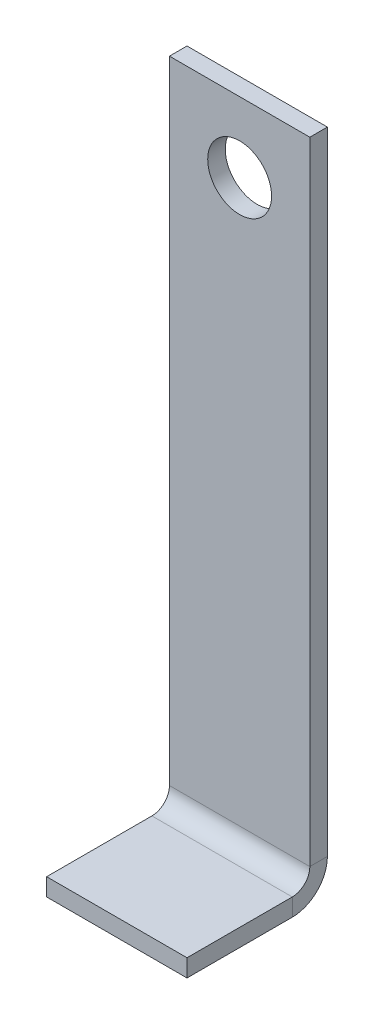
ISO-10303-21;
HEADER;
FILE_DESCRIPTION(('STEP AP214'),'2;1');
FILE_NAME('part.step','',(''),(''),'','','');
FILE_SCHEMA(('AUTOMOTIVE_DESIGN { 1 0 10303 214 1 1 1 1 }'));
ENDSEC;
DATA;
#1=APPLICATION_CONTEXT('core data for automotive mechanical design processes');
#2=APPLICATION_PROTOCOL_DEFINITION('international standard','automotive_design',2000,#1);
#3=PRODUCT_CONTEXT('',#1,'mechanical');
#4=PRODUCT('Part','Part','',(#3));
#5=PRODUCT_RELATED_PRODUCT_CATEGORY('part','',(#4));
#6=PRODUCT_DEFINITION_FORMATION('','',#4);
#7=PRODUCT_DEFINITION_CONTEXT('part definition',#1,'design');
#8=PRODUCT_DEFINITION('design','',#6,#7);
#9=PRODUCT_DEFINITION_SHAPE('','',#8);
#10=(LENGTH_UNIT() NAMED_UNIT(*) SI_UNIT(.MILLI.,.METRE.));
#11=(NAMED_UNIT(*) PLANE_ANGLE_UNIT() SI_UNIT($,.RADIAN.));
#12=(NAMED_UNIT(*) SI_UNIT($,.STERADIAN.) SOLID_ANGLE_UNIT());
#13=UNCERTAINTY_MEASURE_WITH_UNIT(LENGTH_MEASURE(1.E-05),#10,'distance_accuracy_value','');
#14=(GEOMETRIC_REPRESENTATION_CONTEXT(3) GLOBAL_UNCERTAINTY_ASSIGNED_CONTEXT((#13)) GLOBAL_UNIT_ASSIGNED_CONTEXT((#10,
#11,#12)) REPRESENTATION_CONTEXT('',''));
#15=CARTESIAN_POINT('',(0.,0.,0.));
#16=DIRECTION('',(0.,0.,1.));
#17=DIRECTION('',(1.,0.,0.));
#18=AXIS2_PLACEMENT_3D('',#15,#16,#17);
#19=CARTESIAN_POINT('',(9.99999999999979,0.,-14.9999999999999));
#20=DIRECTION('',(1.,0.,0.));
#21=DIRECTION('',(0.,0.,-1.));
#22=AXIS2_PLACEMENT_3D('',#19,#20,#21);
#23=PLANE('',#22);
#24=DIRECTION('',(0.,1.,0.));
#25=VECTOR('',#24,1.);
#26=CARTESIAN_POINT('',(9.99999999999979,0.,-14.9999999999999));
#27=LINE('',#26,#25);
#28=CARTESIAN_POINT('',(9.99999999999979,0.,-14.9999999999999));
#29=VERTEX_POINT('',#28);
#30=CARTESIAN_POINT('',(9.99999999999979,2.50000000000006,-14.9999999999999));
#31=VERTEX_POINT('',#30);
#32=EDGE_CURVE('E11',#29,#31,#27,.T.);
#33=ORIENTED_EDGE('',*,*,#32,.F.);
#34=CARTESIAN_POINT('',(9.99999999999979,5.,-14.9999999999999));
#35=DIRECTION('',(-1.,0.,0.));
#36=DIRECTION('',(0.,0.,1.));
#37=AXIS2_PLACEMENT_3D('',#34,#35,#36);
#38=CIRCLE('',#37,5.);
#39=CARTESIAN_POINT('',(10.,4.99999999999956,-19.9999999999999));
#40=VERTEX_POINT('',#39);
#41=EDGE_CURVE('E180',#29,#40,#38,.F.);
#42=ORIENTED_EDGE('',*,*,#41,.T.);
#43=DIRECTION('',(0.,0.,-1.));
#44=VECTOR('',#43,1.);
#45=CARTESIAN_POINT('',(10.,5.,-17.4999999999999));
#46=LINE('',#45,#44);
#47=CARTESIAN_POINT('',(10.,5.,-17.4999999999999));
#48=VERTEX_POINT('',#47);
#49=EDGE_CURVE('E49',#48,#40,#46,.T.);
#50=ORIENTED_EDGE('',*,*,#49,.F.);
#51=CARTESIAN_POINT('',(9.99999999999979,5.,-14.9999999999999));
#52=DIRECTION('',(1.,0.,0.));
#53=DIRECTION('',(0.,0.,-1.));
#54=AXIS2_PLACEMENT_3D('',#51,#52,#53);
#55=CIRCLE('',#54,2.5);
#56=EDGE_CURVE('E165',#31,#48,#55,.T.);
#57=ORIENTED_EDGE('',*,*,#56,.F.);
#58=EDGE_LOOP('',(#33,#42,#50,#57));
#59=FACE_BOUND('',#58,.T.);
#60=ADVANCED_FACE('F40',(#59),#23,.T.);
#61=CARTESIAN_POINT('',(10.,5.,-17.4999999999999));
#62=DIRECTION('',(1.,0.,0.));
#63=DIRECTION('',(0.,0.,-1.));
#64=AXIS2_PLACEMENT_3D('',#61,#62,#63);
#65=PLANE('',#64);
#66=DIRECTION('',(0.,0.,-1.));
#67=VECTOR('',#66,1.);
#68=CARTESIAN_POINT('',(10.,0.,1.11022302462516E-13));
#69=LINE('',#68,#67);
#70=CARTESIAN_POINT('',(10.,0.,1.11022302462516E-13));
#71=VERTEX_POINT('',#70);
#72=EDGE_CURVE('E177',#71,#29,#69,.T.);
#73=ORIENTED_EDGE('',*,*,#72,.T.);
#74=ORIENTED_EDGE('',*,*,#32,.T.);
#75=DIRECTION('',(0.,0.,-1.));
#76=VECTOR('',#75,1.);
#77=CARTESIAN_POINT('',(10.,2.50000000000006,1.11022302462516E-13));
#78=LINE('',#77,#76);
#79=CARTESIAN_POINT('',(10.,2.50000000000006,1.11022302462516E-13));
#80=VERTEX_POINT('',#79);
#81=EDGE_CURVE('E169',#80,#31,#78,.T.);
#82=ORIENTED_EDGE('',*,*,#81,.F.);
#83=DIRECTION('',(0.,1.,0.));
#84=VECTOR('',#83,1.);
#85=CARTESIAN_POINT('',(10.,0.,1.11022302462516E-13));
#86=LINE('',#85,#84);
#87=EDGE_CURVE('E173',#71,#80,#86,.T.);
#88=ORIENTED_EDGE('',*,*,#87,.F.);
#89=EDGE_LOOP('',(#73,#74,#82,#88));
#90=FACE_BOUND('',#89,.T.);
#91=ADVANCED_FACE('F244',(#90),#65,.T.);
#92=CARTESIAN_POINT('',(-10.,4.99999999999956,-20.));
#93=DIRECTION('',(-1.,0.,0.));
#94=DIRECTION('',(0.,0.,1.));
#95=AXIS2_PLACEMENT_3D('',#92,#93,#94);
#96=PLANE('',#95);
#97=DIRECTION('',(0.,0.,1.));
#98=VECTOR('',#97,1.);
#99=CARTESIAN_POINT('',(-10.,4.99999999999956,-20.));
#100=LINE('',#99,#98);
#101=CARTESIAN_POINT('',(-10.,4.99999999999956,-20.));
#102=VERTEX_POINT('',#101);
#103=CARTESIAN_POINT('',(-10.,5.,-17.5));
#104=VERTEX_POINT('',#103);
#105=EDGE_CURVE('E207',#102,#104,#100,.T.);
#106=ORIENTED_EDGE('',*,*,#105,.F.);
#107=CARTESIAN_POINT('',(-10.0000000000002,5.,-15.));
#108=DIRECTION('',(-1.,0.,0.));
#109=DIRECTION('',(0.,0.,1.));
#110=AXIS2_PLACEMENT_3D('',#107,#108,#109);
#111=CIRCLE('',#110,5.);
#112=CARTESIAN_POINT('',(-10.0000000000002,0.,-15.));
#113=VERTEX_POINT('',#112);
#114=EDGE_CURVE('E152',#113,#102,#111,.F.);
#115=ORIENTED_EDGE('',*,*,#114,.F.);
#116=DIRECTION('',(0.,-1.,0.));
#117=VECTOR('',#116,1.);
#118=CARTESIAN_POINT('',(-10.0000000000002,2.50000000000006,-15.));
#119=LINE('',#118,#117);
#120=CARTESIAN_POINT('',(-10.0000000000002,2.50000000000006,-15.));
#121=VERTEX_POINT('',#120);
#122=EDGE_CURVE('E115',#121,#113,#119,.T.);
#123=ORIENTED_EDGE('',*,*,#122,.F.);
#124=CARTESIAN_POINT('',(-10.0000000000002,5.,-15.));
#125=DIRECTION('',(1.,0.,0.));
#126=DIRECTION('',(0.,0.,-1.));
#127=AXIS2_PLACEMENT_3D('',#124,#125,#126);
#128=CIRCLE('',#127,2.5);
#129=EDGE_CURVE('E133',#121,#104,#128,.T.);
#130=ORIENTED_EDGE('',*,*,#129,.T.);
#131=EDGE_LOOP('',(#106,#115,#123,#130));
#132=FACE_BOUND('',#131,.T.);
#133=ADVANCED_FACE('F230',(#132),#96,.T.);
#134=CARTESIAN_POINT('',(-10.0000000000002,2.50000000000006,-15.));
#135=DIRECTION('',(-1.,0.,0.));
#136=DIRECTION('',(0.,0.,1.));
#137=AXIS2_PLACEMENT_3D('',#134,#135,#136);
#138=PLANE('',#137);
#139=DIRECTION('',(0.,1.,0.));
#140=VECTOR('',#139,1.);
#141=CARTESIAN_POINT('',(-10.,-4.44089209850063E-13,-20.));
#142=LINE('',#141,#140);
#143=CARTESIAN_POINT('',(-10.,94.9999999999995,-19.9999999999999));
#144=VERTEX_POINT('',#143);
#145=EDGE_CURVE('E120',#102,#144,#142,.T.);
#146=ORIENTED_EDGE('',*,*,#145,.F.);
#147=ORIENTED_EDGE('',*,*,#105,.T.);
#148=DIRECTION('',(0.,1.,0.));
#149=VECTOR('',#148,1.);
#150=CARTESIAN_POINT('',(-10.,0.,-17.5));
#151=LINE('',#150,#149);
#152=CARTESIAN_POINT('',(-10.,95.,-17.4999999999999));
#153=VERTEX_POINT('',#152);
#154=EDGE_CURVE('E129',#104,#153,#151,.T.);
#155=ORIENTED_EDGE('',*,*,#154,.T.);
#156=DIRECTION('',(0.,0.,-1.));
#157=VECTOR('',#156,1.);
#158=CARTESIAN_POINT('',(-10.,95.,-17.4999999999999));
#159=LINE('',#158,#157);
#160=EDGE_CURVE('E108',#153,#144,#159,.T.);
#161=ORIENTED_EDGE('',*,*,#160,.T.);
#162=EDGE_LOOP('',(#146,#147,#155,#161));
#163=FACE_BOUND('',#162,.T.);
#164=ADVANCED_FACE('F127',(#163),#138,.T.);
#165=CARTESIAN_POINT('',(10.,-4.44089209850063E-13,-19.9999999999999));
#166=DIRECTION('',(0.,0.,1.));
#167=DIRECTION('',(1.,0.,0.));
#168=AXIS2_PLACEMENT_3D('',#165,#166,#167);
#169=PLANE('',#168);
#170=CARTESIAN_POINT('',(0.,84.9999999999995,-20.));
#171=DIRECTION('',(0.,0.,-1.));
#172=DIRECTION('',(-1.,0.,0.));
#173=AXIS2_PLACEMENT_3D('',#170,#171,#172);
#174=CIRCLE('',#173,4.54999999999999);
#175=CARTESIAN_POINT('',(-4.54999999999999,84.9999999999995,-20.));
#176=VERTEX_POINT('',#175);
#177=EDGE_CURVE('E212',#176,#176,#174,.T.);
#178=ORIENTED_EDGE('',*,*,#177,.F.);
#179=EDGE_LOOP('',(#178));
#180=FACE_BOUND('',#179,.T.);
#181=ORIENTED_EDGE('',*,*,#145,.T.);
#182=DIRECTION('',(-1.,0.,0.));
#183=VECTOR('',#182,1.);
#184=CARTESIAN_POINT('',(10.,94.9999999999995,-19.9999999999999));
#185=LINE('',#184,#183);
#186=CARTESIAN_POINT('',(10.,94.9999999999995,-19.9999999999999));
#187=VERTEX_POINT('',#186);
#188=EDGE_CURVE('E104',#187,#144,#185,.T.);
#189=ORIENTED_EDGE('',*,*,#188,.F.);
#190=DIRECTION('',(0.,1.,0.));
#191=VECTOR('',#190,1.);
#192=CARTESIAN_POINT('',(10.,-4.44089209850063E-13,-19.9999999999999));
#193=LINE('',#192,#191);
#194=EDGE_CURVE('E156',#40,#187,#193,.T.);
#195=ORIENTED_EDGE('',*,*,#194,.F.);
#196=DIRECTION('',(-1.,0.,0.));
#197=VECTOR('',#196,1.);
#198=CARTESIAN_POINT('',(10.,4.99999999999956,-19.9999999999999));
#199=LINE('',#198,#197);
#200=EDGE_CURVE('E123',#40,#102,#199,.T.);
#201=ORIENTED_EDGE('',*,*,#200,.T.);
#202=EDGE_LOOP('',(#181,#189,#195,#201));
#203=FACE_BOUND('',#202,.T.);
#204=ADVANCED_FACE('F121',(#180,#203),#169,.F.);
#205=CARTESIAN_POINT('',(10.,95.,-17.4999999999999));
#206=DIRECTION('',(0.,1.,0.));
#207=DIRECTION('',(0.,0.,1.));
#208=AXIS2_PLACEMENT_3D('',#205,#206,#207);
#209=PLANE('',#208);
#210=ORIENTED_EDGE('',*,*,#160,.F.);
#211=DIRECTION('',(-1.,0.,0.));
#212=VECTOR('',#211,1.);
#213=CARTESIAN_POINT('',(10.,95.,-17.4999999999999));
#214=LINE('',#213,#212);
#215=CARTESIAN_POINT('',(10.,95.,-17.4999999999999));
#216=VERTEX_POINT('',#215);
#217=EDGE_CURVE('E116',#216,#153,#214,.T.);
#218=ORIENTED_EDGE('',*,*,#217,.F.);
#219=DIRECTION('',(0.,0.,-1.));
#220=VECTOR('',#219,1.);
#221=CARTESIAN_POINT('',(10.,95.,-17.4999999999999));
#222=LINE('',#221,#220);
#223=EDGE_CURVE('E111',#216,#187,#222,.T.);
#224=ORIENTED_EDGE('',*,*,#223,.T.);
#225=ORIENTED_EDGE('',*,*,#188,.T.);
#226=EDGE_LOOP('',(#210,#218,#224,#225));
#227=FACE_BOUND('',#226,.T.);
#228=ADVANCED_FACE('F106',(#227),#209,.T.);
#229=CARTESIAN_POINT('',(10.,0.,-17.4999999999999));
#230=DIRECTION('',(0.,0.,1.));
#231=DIRECTION('',(1.,0.,0.));
#232=AXIS2_PLACEMENT_3D('',#229,#230,#231);
#233=PLANE('',#232);
#234=CARTESIAN_POINT('',(0.,85.,-17.5));
#235=DIRECTION('',(0.,0.,1.));
#236=DIRECTION('',(1.,0.,0.));
#237=AXIS2_PLACEMENT_3D('',#234,#235,#236);
#238=CIRCLE('',#237,4.54999999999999);
#239=CARTESIAN_POINT('',(4.54999999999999,85.,-17.5));
#240=VERTEX_POINT('',#239);
#241=EDGE_CURVE('E43',#240,#240,#238,.T.);
#242=ORIENTED_EDGE('',*,*,#241,.F.);
#243=EDGE_LOOP('',(#242));
#244=FACE_BOUND('',#243,.T.);
#245=ORIENTED_EDGE('',*,*,#154,.F.);
#246=DIRECTION('',(-1.,0.,0.));
#247=VECTOR('',#246,1.);
#248=CARTESIAN_POINT('',(10.,5.,-17.4999999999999));
#249=LINE('',#248,#247);
#250=EDGE_CURVE('E199',#48,#104,#249,.T.);
#251=ORIENTED_EDGE('',*,*,#250,.F.);
#252=DIRECTION('',(0.,1.,0.));
#253=VECTOR('',#252,1.);
#254=CARTESIAN_POINT('',(10.,0.,-17.4999999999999));
#255=LINE('',#254,#253);
#256=EDGE_CURVE('E161',#48,#216,#255,.T.);
#257=ORIENTED_EDGE('',*,*,#256,.T.);
#258=ORIENTED_EDGE('',*,*,#217,.T.);
#259=EDGE_LOOP('',(#245,#251,#257,#258));
#260=FACE_BOUND('',#259,.T.);
#261=ADVANCED_FACE('F222',(#244,#260),#233,.T.);
#262=CARTESIAN_POINT('',(9.99999999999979,5.,-14.9999999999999));
#263=DIRECTION('',(-1.,0.,0.));
#264=DIRECTION('',(0.,0.,1.));
#265=AXIS2_PLACEMENT_3D('',#262,#263,#264);
#266=CYLINDRICAL_SURFACE('',#265,2.5);
#267=ORIENTED_EDGE('',*,*,#129,.F.);
#268=DIRECTION('',(-1.,0.,0.));
#269=VECTOR('',#268,1.);
#270=CARTESIAN_POINT('',(9.99999999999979,2.50000000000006,-14.9999999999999));
#271=LINE('',#270,#269);
#272=EDGE_CURVE('E195',#31,#121,#271,.T.);
#273=ORIENTED_EDGE('',*,*,#272,.F.);
#274=ORIENTED_EDGE('',*,*,#56,.T.);
#275=ORIENTED_EDGE('',*,*,#250,.T.);
#276=EDGE_LOOP('',(#267,#273,#274,#275));
#277=FACE_BOUND('',#276,.T.);
#278=ADVANCED_FACE('F225',(#277),#266,.F.);
#279=CARTESIAN_POINT('',(10.,2.50000000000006,1.11022302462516E-13));
#280=DIRECTION('',(0.,1.,0.));
#281=DIRECTION('',(0.,0.,1.));
#282=AXIS2_PLACEMENT_3D('',#279,#280,#281);
#283=PLANE('',#282);
#284=DIRECTION('',(0.,0.,-1.));
#285=VECTOR('',#284,1.);
#286=CARTESIAN_POINT('',(-10.,2.49999999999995,0.));
#287=LINE('',#286,#285);
#288=CARTESIAN_POINT('',(-10.,2.49999999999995,0.));
#289=VERTEX_POINT('',#288);
#290=EDGE_CURVE('E140',#289,#121,#287,.T.);
#291=ORIENTED_EDGE('',*,*,#290,.F.);
#292=DIRECTION('',(-1.,0.,0.));
#293=VECTOR('',#292,1.);
#294=CARTESIAN_POINT('',(10.,2.50000000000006,1.11022302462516E-13));
#295=LINE('',#294,#293);
#296=EDGE_CURVE('E192',#80,#289,#295,.T.);
#297=ORIENTED_EDGE('',*,*,#296,.F.);
#298=ORIENTED_EDGE('',*,*,#81,.T.);
#299=ORIENTED_EDGE('',*,*,#272,.T.);
#300=EDGE_LOOP('',(#291,#297,#298,#299));
#301=FACE_BOUND('',#300,.T.);
#302=ADVANCED_FACE('F240',(#301),#283,.T.);
#303=CARTESIAN_POINT('',(10.,0.,1.11022302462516E-13));
#304=DIRECTION('',(0.,0.,1.));
#305=DIRECTION('',(1.,0.,0.));
#306=AXIS2_PLACEMENT_3D('',#303,#304,#305);
#307=PLANE('',#306);
#308=DIRECTION('',(0.,1.,0.));
#309=VECTOR('',#308,1.);
#310=CARTESIAN_POINT('',(-10.,0.,0.));
#311=LINE('',#310,#309);
#312=CARTESIAN_POINT('',(-10.,0.,0.));
#313=VERTEX_POINT('',#312);
#314=EDGE_CURVE('E144',#313,#289,#311,.T.);
#315=ORIENTED_EDGE('',*,*,#314,.F.);
#316=DIRECTION('',(-1.,0.,0.));
#317=VECTOR('',#316,1.);
#318=CARTESIAN_POINT('',(10.,0.,1.11022302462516E-13));
#319=LINE('',#318,#317);
#320=EDGE_CURVE('E189',#71,#313,#319,.T.);
#321=ORIENTED_EDGE('',*,*,#320,.F.);
#322=ORIENTED_EDGE('',*,*,#87,.T.);
#323=ORIENTED_EDGE('',*,*,#296,.T.);
#324=EDGE_LOOP('',(#315,#321,#322,#323));
#325=FACE_BOUND('',#324,.T.);
#326=ADVANCED_FACE('F246',(#325),#307,.T.);
#327=CARTESIAN_POINT('',(10.,0.,1.11022302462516E-13));
#328=DIRECTION('',(0.,1.,0.));
#329=DIRECTION('',(0.,0.,1.));
#330=AXIS2_PLACEMENT_3D('',#327,#328,#329);
#331=PLANE('',#330);
#332=DIRECTION('',(0.,0.,-1.));
#333=VECTOR('',#332,1.);
#334=CARTESIAN_POINT('',(-10.,0.,0.));
#335=LINE('',#334,#333);
#336=EDGE_CURVE('E148',#313,#113,#335,.T.);
#337=ORIENTED_EDGE('',*,*,#336,.T.);
#338=DIRECTION('',(-1.,0.,0.));
#339=VECTOR('',#338,1.);
#340=CARTESIAN_POINT('',(9.99999999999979,0.,-14.9999999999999));
#341=LINE('',#340,#339);
#342=EDGE_CURVE('E185',#29,#113,#341,.T.);
#343=ORIENTED_EDGE('',*,*,#342,.F.);
#344=ORIENTED_EDGE('',*,*,#72,.F.);
#345=ORIENTED_EDGE('',*,*,#320,.T.);
#346=EDGE_LOOP('',(#337,#343,#344,#345));
#347=FACE_BOUND('',#346,.T.);
#348=ADVANCED_FACE('F250',(#347),#331,.F.);
#349=CARTESIAN_POINT('',(9.99999999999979,5.,-14.9999999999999));
#350=DIRECTION('',(-1.,0.,0.));
#351=DIRECTION('',(0.,0.,1.));
#352=AXIS2_PLACEMENT_3D('',#349,#350,#351);
#353=CYLINDRICAL_SURFACE('',#352,5.);
#354=ORIENTED_EDGE('',*,*,#114,.T.);
#355=ORIENTED_EDGE('',*,*,#200,.F.);
#356=ORIENTED_EDGE('',*,*,#41,.F.);
#357=ORIENTED_EDGE('',*,*,#342,.T.);
#358=EDGE_LOOP('',(#354,#355,#356,#357));
#359=FACE_BOUND('',#358,.T.);
#360=ADVANCED_FACE('F253',(#359),#353,.T.);
#361=CARTESIAN_POINT('',(9.99999999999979,5.,-14.9999999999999));
#362=DIRECTION('',(1.,0.,0.));
#363=DIRECTION('',(0.,0.,-1.));
#364=AXIS2_PLACEMENT_3D('',#361,#362,#363);
#365=PLANE('',#364);
#366=ORIENTED_EDGE('',*,*,#194,.T.);
#367=ORIENTED_EDGE('',*,*,#223,.F.);
#368=ORIENTED_EDGE('',*,*,#256,.F.);
#369=ORIENTED_EDGE('',*,*,#49,.T.);
#370=EDGE_LOOP('',(#366,#367,#368,#369));
#371=FACE_BOUND('',#370,.T.);
#372=ADVANCED_FACE('F280',(#371),#365,.T.);
#373=CARTESIAN_POINT('',(-10.0000000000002,5.,-15.));
#374=DIRECTION('',(1.,0.,0.));
#375=DIRECTION('',(0.,0.,-1.));
#376=AXIS2_PLACEMENT_3D('',#373,#374,#375);
#377=PLANE('',#376);
#378=ORIENTED_EDGE('',*,*,#290,.T.);
#379=ORIENTED_EDGE('',*,*,#122,.T.);
#380=ORIENTED_EDGE('',*,*,#336,.F.);
#381=ORIENTED_EDGE('',*,*,#314,.T.);
#382=EDGE_LOOP('',(#378,#379,#380,#381));
#383=FACE_BOUND('',#382,.T.);
#384=ADVANCED_FACE('F236',(#383),#377,.F.);
#385=CARTESIAN_POINT('',(0.,84.9999999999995,-20.));
#386=DIRECTION('',(0.,0.,-1.));
#387=DIRECTION('',(-1.,0.,0.));
#388=AXIS2_PLACEMENT_3D('',#385,#386,#387);
#389=CYLINDRICAL_SURFACE('',#388,4.54999999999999);
#390=ORIENTED_EDGE('',*,*,#241,.T.);
#391=EDGE_LOOP('',(#390));
#392=FACE_BOUND('',#391,.T.);
#393=ORIENTED_EDGE('',*,*,#177,.T.);
#394=EDGE_LOOP('',(#393));
#395=FACE_BOUND('',#394,.T.);
#396=ADVANCED_FACE('F220',(#392,#395),#389,.F.);
#397=CLOSED_SHELL('',(#60,#91,#133,#164,#204,#228,#261,#278,#302,#326,#348,#360,#372,#384,#396));
#398=MANIFOLD_SOLID_BREP('B2',#397);
#399=ADVANCED_BREP_SHAPE_REPRESENTATION('',(#18,#398),#14);
#400=SHAPE_DEFINITION_REPRESENTATION(#9,#399);
ENDSEC;
END-ISO-10303-21;
